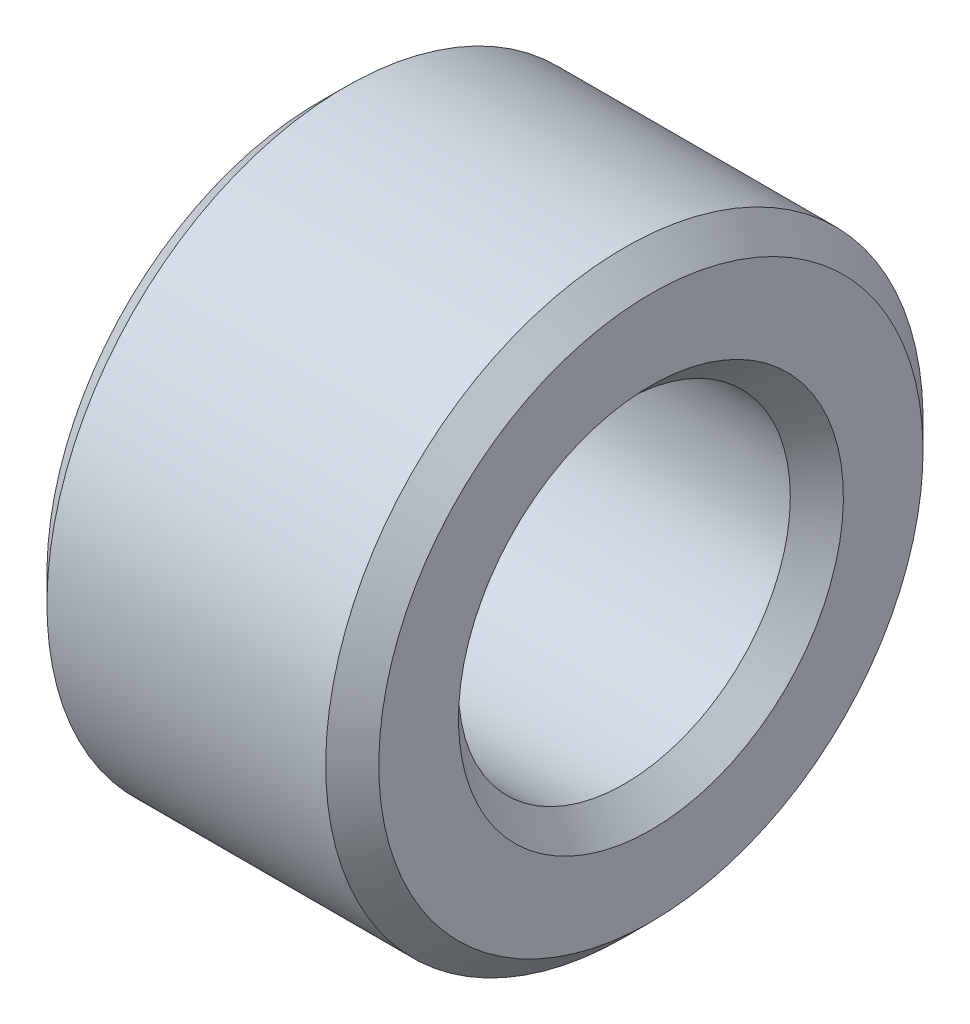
ISO-10303-21;
HEADER;
FILE_DESCRIPTION(('STEP AP214'),'2;1');
FILE_NAME('part.step','',(''),(''),'','','');
FILE_SCHEMA(('AUTOMOTIVE_DESIGN { 1 0 10303 214 1 1 1 1 }'));
ENDSEC;
DATA;
#1=APPLICATION_CONTEXT('core data for automotive mechanical design processes');
#2=APPLICATION_PROTOCOL_DEFINITION('international standard','automotive_design',2000,#1);
#3=PRODUCT_CONTEXT('',#1,'mechanical');
#4=PRODUCT('Part','Part','',(#3));
#5=PRODUCT_RELATED_PRODUCT_CATEGORY('part','',(#4));
#6=PRODUCT_DEFINITION_FORMATION('','',#4);
#7=PRODUCT_DEFINITION_CONTEXT('part definition',#1,'design');
#8=PRODUCT_DEFINITION('design','',#6,#7);
#9=PRODUCT_DEFINITION_SHAPE('','',#8);
#10=(LENGTH_UNIT() NAMED_UNIT(*) SI_UNIT(.MILLI.,.METRE.));
#11=(NAMED_UNIT(*) PLANE_ANGLE_UNIT() SI_UNIT($,.RADIAN.));
#12=(NAMED_UNIT(*) SI_UNIT($,.STERADIAN.) SOLID_ANGLE_UNIT());
#13=UNCERTAINTY_MEASURE_WITH_UNIT(LENGTH_MEASURE(1.E-05),#10,'distance_accuracy_value','');
#14=(GEOMETRIC_REPRESENTATION_CONTEXT(3) GLOBAL_UNCERTAINTY_ASSIGNED_CONTEXT((#13)) GLOBAL_UNIT_ASSIGNED_CONTEXT((#10,
#11,#12)) REPRESENTATION_CONTEXT('',''));
#15=CARTESIAN_POINT('',(0.,0.,0.));
#16=DIRECTION('',(0.,0.,1.));
#17=DIRECTION('',(1.,0.,0.));
#18=AXIS2_PLACEMENT_3D('',#15,#16,#17);
#19=CARTESIAN_POINT('',(0.,-3.5,0.));
#20=DIRECTION('',(-1.,0.,0.));
#21=DIRECTION('',(0.,1.,0.));
#22=AXIS2_PLACEMENT_3D('',#19,#20,#21);
#23=PLANE('',#22);
#24=CARTESIAN_POINT('',(0.,0.,0.));
#25=DIRECTION('',(1.,0.,0.));
#26=DIRECTION('',(0.,-1.,0.));
#27=AXIS2_PLACEMENT_3D('',#24,#25,#26);
#28=CIRCLE('',#27,2.9);
#29=CARTESIAN_POINT('',(0.,-2.9,0.));
#30=VERTEX_POINT('',#29);
#31=EDGE_CURVE('E9',#30,#30,#28,.T.);
#32=ORIENTED_EDGE('',*,*,#31,.T.);
#33=EDGE_LOOP('',(#32));
#34=FACE_BOUND('',#33,.T.);
#35=CARTESIAN_POINT('',(0.,0.,0.));
#36=DIRECTION('',(1.,0.,0.));
#37=DIRECTION('',(0.,-1.,0.));
#38=AXIS2_PLACEMENT_3D('',#35,#36,#37);
#39=CIRCLE('',#38,4.1);
#40=CARTESIAN_POINT('',(0.,-4.1,0.));
#41=VERTEX_POINT('',#40);
#42=EDGE_CURVE('E53',#41,#41,#39,.T.);
#43=ORIENTED_EDGE('',*,*,#42,.F.);
#44=EDGE_LOOP('',(#43));
#45=FACE_BOUND('',#44,.T.);
#46=ADVANCED_FACE('F15',(#34,#45),#23,.T.);
#47=CARTESIAN_POINT('',(0.2,0.,0.));
#48=DIRECTION('',(-1.,0.,0.));
#49=DIRECTION('',(0.,-1.,0.));
#50=AXIS2_PLACEMENT_3D('',#47,#48,#49);
#51=CONICAL_SURFACE('',#50,2.7,0.785398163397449);
#52=CARTESIAN_POINT('',(0.4,0.,0.));
#53=DIRECTION('',(1.,0.,0.));
#54=DIRECTION('',(0.,-1.,0.));
#55=AXIS2_PLACEMENT_3D('',#52,#53,#54);
#56=CIRCLE('',#55,2.5);
#57=CARTESIAN_POINT('',(0.4,-2.5,0.));
#58=VERTEX_POINT('',#57);
#59=EDGE_CURVE('E22',#58,#58,#56,.T.);
#60=ORIENTED_EDGE('',*,*,#59,.T.);
#61=EDGE_LOOP('',(#60));
#62=FACE_BOUND('',#61,.T.);
#63=ORIENTED_EDGE('',*,*,#31,.F.);
#64=EDGE_LOOP('',(#63));
#65=FACE_BOUND('',#64,.T.);
#66=ADVANCED_FACE('F82',(#62,#65),#51,.F.);
#67=CARTESIAN_POINT('',(2.5,0.,0.));
#68=DIRECTION('',(-1.,0.,0.));
#69=DIRECTION('',(0.,-1.,0.));
#70=AXIS2_PLACEMENT_3D('',#67,#68,#69);
#71=CYLINDRICAL_SURFACE('',#70,2.5);
#72=CARTESIAN_POINT('',(4.6,0.,0.));
#73=DIRECTION('',(1.,0.,0.));
#74=DIRECTION('',(0.,-1.,0.));
#75=AXIS2_PLACEMENT_3D('',#72,#73,#74);
#76=CIRCLE('',#75,2.5);
#77=CARTESIAN_POINT('',(4.6,-2.5,0.));
#78=VERTEX_POINT('',#77);
#79=EDGE_CURVE('E58',#78,#78,#76,.T.);
#80=ORIENTED_EDGE('',*,*,#79,.T.);
#81=EDGE_LOOP('',(#80));
#82=FACE_BOUND('',#81,.T.);
#83=ORIENTED_EDGE('',*,*,#59,.F.);
#84=EDGE_LOOP('',(#83));
#85=FACE_BOUND('',#84,.T.);
#86=ADVANCED_FACE('F66',(#82,#85),#71,.F.);
#87=CARTESIAN_POINT('',(4.8,0.,0.));
#88=DIRECTION('',(1.,0.,0.));
#89=DIRECTION('',(0.,-1.,0.));
#90=AXIS2_PLACEMENT_3D('',#87,#88,#89);
#91=CONICAL_SURFACE('',#90,2.7,0.78539816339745);
#92=CARTESIAN_POINT('',(5.,0.,0.));
#93=DIRECTION('',(1.,0.,0.));
#94=DIRECTION('',(0.,-1.,0.));
#95=AXIS2_PLACEMENT_3D('',#92,#93,#94);
#96=CIRCLE('',#95,2.9);
#97=CARTESIAN_POINT('',(5.,-2.9,0.));
#98=VERTEX_POINT('',#97);
#99=EDGE_CURVE('E63',#98,#98,#96,.T.);
#100=ORIENTED_EDGE('',*,*,#99,.T.);
#101=EDGE_LOOP('',(#100));
#102=FACE_BOUND('',#101,.T.);
#103=ORIENTED_EDGE('',*,*,#79,.F.);
#104=EDGE_LOOP('',(#103));
#105=FACE_BOUND('',#104,.T.);
#106=ADVANCED_FACE('F69',(#102,#105),#91,.F.);
#107=CARTESIAN_POINT('',(5.,-3.5,0.));
#108=DIRECTION('',(1.,0.,0.));
#109=DIRECTION('',(0.,-1.,0.));
#110=AXIS2_PLACEMENT_3D('',#107,#108,#109);
#111=PLANE('',#110);
#112=CARTESIAN_POINT('',(5.,0.,0.));
#113=DIRECTION('',(1.,0.,0.));
#114=DIRECTION('',(0.,-1.,0.));
#115=AXIS2_PLACEMENT_3D('',#112,#113,#114);
#116=CIRCLE('',#115,4.1);
#117=CARTESIAN_POINT('',(5.,-4.1,0.));
#118=VERTEX_POINT('',#117);
#119=EDGE_CURVE('E61',#118,#118,#116,.T.);
#120=ORIENTED_EDGE('',*,*,#119,.T.);
#121=EDGE_LOOP('',(#120));
#122=FACE_BOUND('',#121,.T.);
#123=ORIENTED_EDGE('',*,*,#99,.F.);
#124=EDGE_LOOP('',(#123));
#125=FACE_BOUND('',#124,.T.);
#126=ADVANCED_FACE('F71',(#122,#125),#111,.T.);
#127=CARTESIAN_POINT('',(4.8,0.,0.));
#128=DIRECTION('',(-1.,0.,0.));
#129=DIRECTION('',(0.,-1.,0.));
#130=AXIS2_PLACEMENT_3D('',#127,#128,#129);
#131=CONICAL_SURFACE('',#130,4.3,0.785398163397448);
#132=CARTESIAN_POINT('',(4.6,0.,0.));
#133=DIRECTION('',(1.,0.,0.));
#134=DIRECTION('',(0.,-1.,0.));
#135=AXIS2_PLACEMENT_3D('',#132,#133,#134);
#136=CIRCLE('',#135,4.5);
#137=CARTESIAN_POINT('',(4.6,-4.5,0.));
#138=VERTEX_POINT('',#137);
#139=EDGE_CURVE('E55',#138,#138,#136,.T.);
#140=ORIENTED_EDGE('',*,*,#139,.T.);
#141=EDGE_LOOP('',(#140));
#142=FACE_BOUND('',#141,.T.);
#143=ORIENTED_EDGE('',*,*,#119,.F.);
#144=EDGE_LOOP('',(#143));
#145=FACE_BOUND('',#144,.T.);
#146=ADVANCED_FACE('F79',(#142,#145),#131,.T.);
#147=CARTESIAN_POINT('',(2.5,0.,0.));
#148=DIRECTION('',(-1.,0.,0.));
#149=DIRECTION('',(0.,-1.,0.));
#150=AXIS2_PLACEMENT_3D('',#147,#148,#149);
#151=CYLINDRICAL_SURFACE('',#150,4.5);
#152=CARTESIAN_POINT('',(0.4,0.,0.));
#153=DIRECTION('',(1.,0.,0.));
#154=DIRECTION('',(0.,-1.,0.));
#155=AXIS2_PLACEMENT_3D('',#152,#153,#154);
#156=CIRCLE('',#155,4.5);
#157=CARTESIAN_POINT('',(0.4,-4.5,0.));
#158=VERTEX_POINT('',#157);
#159=EDGE_CURVE('E49',#158,#158,#156,.T.);
#160=ORIENTED_EDGE('',*,*,#159,.T.);
#161=EDGE_LOOP('',(#160));
#162=FACE_BOUND('',#161,.T.);
#163=ORIENTED_EDGE('',*,*,#139,.F.);
#164=EDGE_LOOP('',(#163));
#165=FACE_BOUND('',#164,.T.);
#166=ADVANCED_FACE('F50',(#162,#165),#151,.T.);
#167=CARTESIAN_POINT('',(0.2,0.,0.));
#168=DIRECTION('',(1.,0.,0.));
#169=DIRECTION('',(0.,-1.,0.));
#170=AXIS2_PLACEMENT_3D('',#167,#168,#169);
#171=CONICAL_SURFACE('',#170,4.3,0.785398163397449);
#172=ORIENTED_EDGE('',*,*,#42,.T.);
#173=EDGE_LOOP('',(#172));
#174=FACE_BOUND('',#173,.T.);
#175=ORIENTED_EDGE('',*,*,#159,.F.);
#176=EDGE_LOOP('',(#175));
#177=FACE_BOUND('',#176,.T.);
#178=ADVANCED_FACE('F92',(#174,#177),#171,.T.);
#179=CLOSED_SHELL('',(#46,#66,#86,#106,#126,#146,#166,#178));
#180=MANIFOLD_SOLID_BREP('B1',#179);
#181=ADVANCED_BREP_SHAPE_REPRESENTATION('',(#18,#180),#14);
#182=SHAPE_DEFINITION_REPRESENTATION(#9,#181);
ENDSEC;
END-ISO-10303-21;
